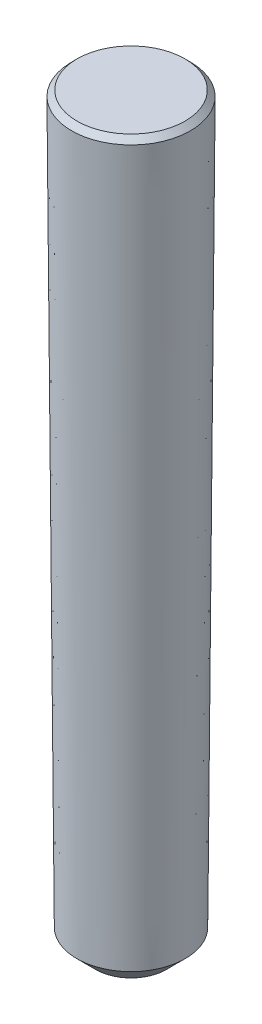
ISO-10303-21;
HEADER;
FILE_DESCRIPTION(('STEP AP214'),'2;1');
FILE_NAME('part.step','',(''),(''),'','','');
FILE_SCHEMA(('AUTOMOTIVE_DESIGN { 1 0 10303 214 1 1 1 1 }'));
ENDSEC;
DATA;
#1=APPLICATION_CONTEXT('core data for automotive mechanical design processes');
#2=APPLICATION_PROTOCOL_DEFINITION('international standard','automotive_design',2000,#1);
#3=PRODUCT_CONTEXT('',#1,'mechanical');
#4=PRODUCT('Part','Part','',(#3));
#5=PRODUCT_RELATED_PRODUCT_CATEGORY('part','',(#4));
#6=PRODUCT_DEFINITION_FORMATION('','',#4);
#7=PRODUCT_DEFINITION_CONTEXT('part definition',#1,'design');
#8=PRODUCT_DEFINITION('design','',#6,#7);
#9=PRODUCT_DEFINITION_SHAPE('','',#8);
#10=(LENGTH_UNIT() NAMED_UNIT(*) SI_UNIT(.MILLI.,.METRE.));
#11=(NAMED_UNIT(*) PLANE_ANGLE_UNIT() SI_UNIT($,.RADIAN.));
#12=(NAMED_UNIT(*) SI_UNIT($,.STERADIAN.) SOLID_ANGLE_UNIT());
#13=UNCERTAINTY_MEASURE_WITH_UNIT(LENGTH_MEASURE(1.E-05),#10,'distance_accuracy_value','');
#14=(GEOMETRIC_REPRESENTATION_CONTEXT(3) GLOBAL_UNCERTAINTY_ASSIGNED_CONTEXT((#13)) GLOBAL_UNIT_ASSIGNED_CONTEXT((#10,
#11,#12)) REPRESENTATION_CONTEXT('',''));
#15=CARTESIAN_POINT('',(0.,0.,0.));
#16=DIRECTION('',(0.,0.,1.));
#17=DIRECTION('',(1.,0.,0.));
#18=AXIS2_PLACEMENT_3D('',#15,#16,#17);
#19=CARTESIAN_POINT('',(-1.6,0.,0.));
#20=DIRECTION('',(0.,1.,0.));
#21=DIRECTION('',(0.,0.,1.));
#22=AXIS2_PLACEMENT_3D('',#19,#20,#21);
#23=PLANE('',#22);
#24=CARTESIAN_POINT('',(0.,0.,0.));
#25=DIRECTION('',(0.,1.,0.));
#26=DIRECTION('',(0.,0.,1.));
#27=AXIS2_PLACEMENT_3D('',#24,#25,#26);
#28=CIRCLE('',#27,1.45107575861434);
#29=CARTESIAN_POINT('',(0.,0.,1.45107575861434));
#30=VERTEX_POINT('',#29);
#31=EDGE_CURVE('E36',#30,#30,#28,.T.);
#32=ORIENTED_EDGE('',*,*,#31,.T.);
#33=EDGE_LOOP('',(#32));
#34=FACE_BOUND('',#33,.T.);
#35=ADVANCED_FACE('F29',(#34),#23,.T.);
#36=CARTESIAN_POINT('',(0.,-20.,0.));
#37=DIRECTION('',(0.,-1.,0.));
#38=DIRECTION('',(0.,0.,-1.));
#39=AXIS2_PLACEMENT_3D('',#36,#37,#38);
#40=PLANE('',#39);
#41=CARTESIAN_POINT('',(0.,-20.,0.));
#42=DIRECTION('',(0.,-1.,0.));
#43=DIRECTION('',(0.,0.,-1.));
#44=AXIS2_PLACEMENT_3D('',#41,#42,#43);
#45=CIRCLE('',#44,0.954999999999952);
#46=CARTESIAN_POINT('',(0.,-20.,-0.954999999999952));
#47=VERTEX_POINT('',#46);
#48=EDGE_CURVE('E40',#47,#47,#45,.T.);
#49=ORIENTED_EDGE('',*,*,#48,.T.);
#50=EDGE_LOOP('',(#49));
#51=FACE_BOUND('',#50,.T.);
#52=ADVANCED_FACE('F60',(#51),#40,.T.);
#53=CARTESIAN_POINT('',(0.,0.,0.));
#54=DIRECTION('',(0.,1.,0.));
#55=DIRECTION('',(0.,0.,1.));
#56=AXIS2_PLACEMENT_3D('',#53,#54,#55);
#57=CONICAL_SURFACE('',#56,1.6,0.00724987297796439);
#58=CARTESIAN_POINT('',(0.,-0.149996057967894,0.));
#59=DIRECTION('',(0.,-1.,0.));
#60=DIRECTION('',(0.,0.,-1.));
#61=AXIS2_PLACEMENT_3D('',#58,#59,#60);
#62=CIRCLE('',#61,1.59891252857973);
#63=CARTESIAN_POINT('',(0.,-0.149996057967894,-1.59891252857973));
#64=VERTEX_POINT('',#63);
#65=EDGE_CURVE('E10',#64,#64,#62,.T.);
#66=ORIENTED_EDGE('',*,*,#65,.T.);
#67=EDGE_LOOP('',(#66));
#68=FACE_BOUND('',#67,.T.);
#69=CARTESIAN_POINT('',(0.,-19.4963485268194,0.));
#70=DIRECTION('',(0.,-1.,0.));
#71=DIRECTION('',(0.,0.,-1.));
#72=AXIS2_PLACEMENT_3D('',#69,#70,#71);
#73=CIRCLE('',#72,1.45865147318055);
#74=CARTESIAN_POINT('',(0.,-19.4963485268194,-1.45865147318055));
#75=VERTEX_POINT('',#74);
#76=EDGE_CURVE('E44',#75,#75,#73,.F.);
#77=ORIENTED_EDGE('',*,*,#76,.T.);
#78=EDGE_LOOP('',(#77));
#79=FACE_BOUND('',#78,.T.);
#80=ADVANCED_FACE('F50',(#68,#79),#57,.T.);
#81=CARTESIAN_POINT('',(0.,-19.4963485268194,0.));
#82=DIRECTION('',(0.,1.,0.));
#83=DIRECTION('',(0.,0.,1.));
#84=AXIS2_PLACEMENT_3D('',#81,#82,#83);
#85=CONICAL_SURFACE('',#84,1.45865147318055,0.785398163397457);
#86=ORIENTED_EDGE('',*,*,#48,.F.);
#87=EDGE_LOOP('',(#86));
#88=FACE_BOUND('',#87,.T.);
#89=ORIENTED_EDGE('',*,*,#76,.F.);
#90=EDGE_LOOP('',(#89));
#91=FACE_BOUND('',#90,.T.);
#92=ADVANCED_FACE('F52',(#88,#91),#85,.T.);
#93=CARTESIAN_POINT('',(0.,0.,0.));
#94=DIRECTION('',(0.,-1.,0.));
#95=DIRECTION('',(0.,0.,-1.));
#96=AXIS2_PLACEMENT_3D('',#93,#94,#95);
#97=CONICAL_SURFACE('',#96,1.45107575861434,0.778148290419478);
#98=ORIENTED_EDGE('',*,*,#65,.F.);
#99=EDGE_LOOP('',(#98));
#100=FACE_BOUND('',#99,.T.);
#101=ORIENTED_EDGE('',*,*,#31,.F.);
#102=EDGE_LOOP('',(#101));
#103=FACE_BOUND('',#102,.T.);
#104=ADVANCED_FACE('F31',(#100,#103),#97,.T.);
#105=CLOSED_SHELL('',(#35,#52,#80,#92,#104));
#106=MANIFOLD_SOLID_BREP('B2',#105);
#107=ADVANCED_BREP_SHAPE_REPRESENTATION('',(#18,#106),#14);
#108=SHAPE_DEFINITION_REPRESENTATION(#9,#107);
ENDSEC;
END-ISO-10303-21;
